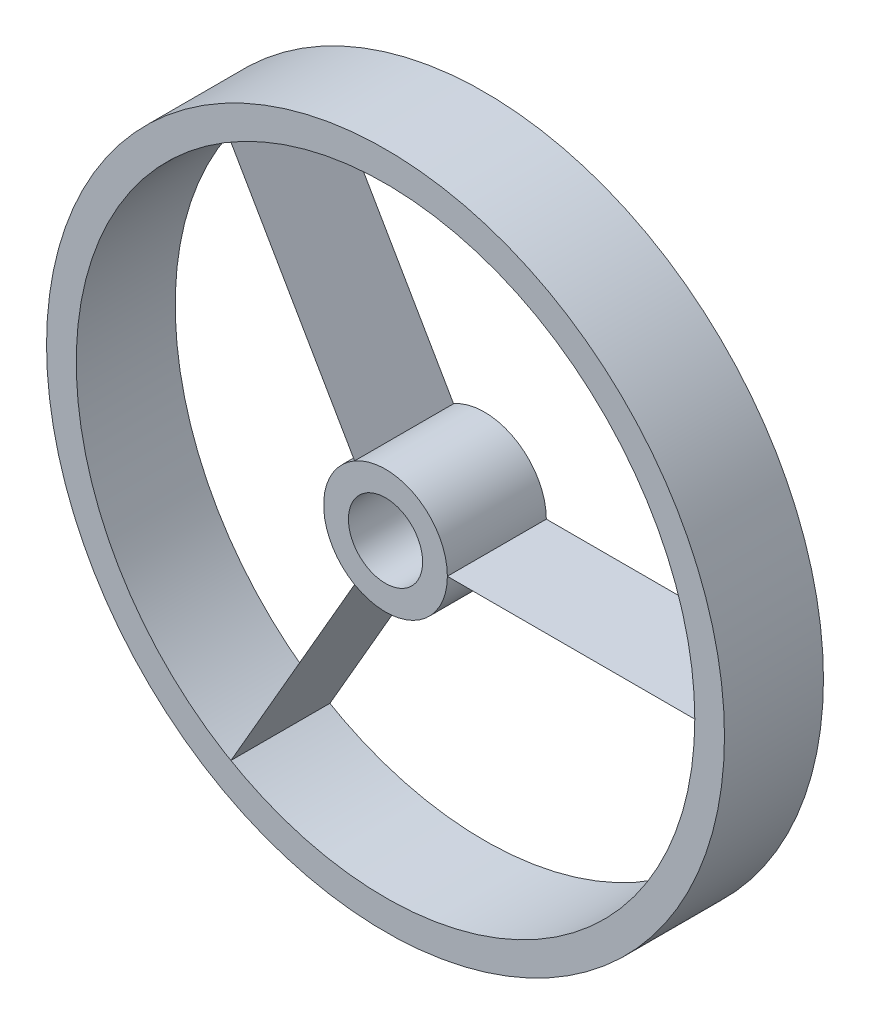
ISO-10303-21;
HEADER;
FILE_DESCRIPTION(('STEP AP214'),'2;1');
FILE_NAME('part.step','',(''),(''),'','','');
FILE_SCHEMA(('AUTOMOTIVE_DESIGN { 1 0 10303 214 1 1 1 1 }'));
ENDSEC;
DATA;
#1=APPLICATION_CONTEXT('core data for automotive mechanical design processes');
#2=APPLICATION_PROTOCOL_DEFINITION('international standard','automotive_design',2000,#1);
#3=PRODUCT_CONTEXT('',#1,'mechanical');
#4=PRODUCT('Part','Part','',(#3));
#5=PRODUCT_RELATED_PRODUCT_CATEGORY('part','',(#4));
#6=PRODUCT_DEFINITION_FORMATION('','',#4);
#7=PRODUCT_DEFINITION_CONTEXT('part definition',#1,'design');
#8=PRODUCT_DEFINITION('design','',#6,#7);
#9=PRODUCT_DEFINITION_SHAPE('','',#8);
#10=(LENGTH_UNIT() NAMED_UNIT(*) SI_UNIT(.MILLI.,.METRE.));
#11=(NAMED_UNIT(*) PLANE_ANGLE_UNIT() SI_UNIT($,.RADIAN.));
#12=(NAMED_UNIT(*) SI_UNIT($,.STERADIAN.) SOLID_ANGLE_UNIT());
#13=UNCERTAINTY_MEASURE_WITH_UNIT(LENGTH_MEASURE(1.E-05),#10,'distance_accuracy_value','');
#14=(GEOMETRIC_REPRESENTATION_CONTEXT(3) GLOBAL_UNCERTAINTY_ASSIGNED_CONTEXT((#13)) GLOBAL_UNIT_ASSIGNED_CONTEXT((#10,
#11,#12)) REPRESENTATION_CONTEXT('',''));
#15=CARTESIAN_POINT('',(0.,0.,0.));
#16=DIRECTION('',(0.,0.,1.));
#17=DIRECTION('',(1.,0.,0.));
#18=AXIS2_PLACEMENT_3D('',#15,#16,#17);
#19=CARTESIAN_POINT('',(-12.5000000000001,-21.6506350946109,40.));
#20=DIRECTION('',(0.866025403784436,-0.500000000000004,0.));
#21=DIRECTION('',(0.500000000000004,0.866025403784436,0.));
#22=AXIS2_PLACEMENT_3D('',#19,#20,#21);
#23=PLANE('',#22);
#24=DIRECTION('',(0.500000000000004,0.866025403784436,0.));
#25=VECTOR('',#24,1.);
#26=CARTESIAN_POINT('',(-12.5000000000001,-21.6506350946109,40.));
#27=LINE('',#26,#25);
#28=CARTESIAN_POINT('',(-62.5000000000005,-108.253175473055,40.));
#29=VERTEX_POINT('',#28);
#30=CARTESIAN_POINT('',(-12.5000000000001,-21.6506350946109,40.));
#31=VERTEX_POINT('',#30);
#32=EDGE_CURVE('E58',#29,#31,#27,.T.);
#33=ORIENTED_EDGE('',*,*,#32,.F.);
#34=DIRECTION('',(0.,0.,-1.));
#35=VECTOR('',#34,1.);
#36=CARTESIAN_POINT('',(-62.5000000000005,-108.253175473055,40.));
#37=LINE('',#36,#35);
#38=CARTESIAN_POINT('',(-62.5000000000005,-108.253175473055,0.));
#39=VERTEX_POINT('',#38);
#40=EDGE_CURVE('E13',#29,#39,#37,.T.);
#41=ORIENTED_EDGE('',*,*,#40,.T.);
#42=DIRECTION('',(0.500000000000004,0.866025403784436,0.));
#43=VECTOR('',#42,1.);
#44=CARTESIAN_POINT('',(-12.5000000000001,-21.6506350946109,0.));
#45=LINE('',#44,#43);
#46=CARTESIAN_POINT('',(-12.5000000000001,-21.6506350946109,0.));
#47=VERTEX_POINT('',#46);
#48=EDGE_CURVE('E73',#39,#47,#45,.T.);
#49=ORIENTED_EDGE('',*,*,#48,.T.);
#50=DIRECTION('',(0.,0.,1.));
#51=VECTOR('',#50,1.);
#52=CARTESIAN_POINT('',(-12.5000000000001,-21.6506350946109,40.));
#53=LINE('',#52,#51);
#54=EDGE_CURVE('E68',#47,#31,#53,.T.);
#55=ORIENTED_EDGE('',*,*,#54,.T.);
#56=EDGE_LOOP('',(#33,#41,#49,#55));
#57=FACE_BOUND('',#56,.T.);
#58=ADVANCED_FACE('F53',(#57),#23,.T.);
#59=OPEN_SHELL('',(#58));
#60=SHELL_BASED_SURFACE_MODEL('B2',(#59));
#61=CARTESIAN_POINT('',(25.,0.,40.));
#62=DIRECTION('',(0.,1.,0.));
#63=DIRECTION('',(0.,0.,1.));
#64=AXIS2_PLACEMENT_3D('',#61,#62,#63);
#65=PLANE('',#64);
#66=DIRECTION('',(0.,0.,1.));
#67=VECTOR('',#66,1.);
#68=CARTESIAN_POINT('',(25.,0.,40.));
#69=LINE('',#68,#67);
#70=CARTESIAN_POINT('',(25.,0.,0.));
#71=VERTEX_POINT('',#70);
#72=CARTESIAN_POINT('',(25.,0.,40.));
#73=VERTEX_POINT('',#72);
#74=EDGE_CURVE('E51',#71,#73,#69,.T.);
#75=ORIENTED_EDGE('',*,*,#74,.F.);
#76=DIRECTION('',(-1.,0.,0.));
#77=VECTOR('',#76,1.);
#78=CARTESIAN_POINT('',(25.,0.,0.));
#79=LINE('',#78,#77);
#80=CARTESIAN_POINT('',(125.,0.,0.));
#81=VERTEX_POINT('',#80);
#82=EDGE_CURVE('E126',#81,#71,#79,.T.);
#83=ORIENTED_EDGE('',*,*,#82,.F.);
#84=DIRECTION('',(0.,0.,-1.));
#85=VECTOR('',#84,1.);
#86=CARTESIAN_POINT('',(125.,0.,40.));
#87=LINE('',#86,#85);
#88=CARTESIAN_POINT('',(125.,0.,40.));
#89=VERTEX_POINT('',#88);
#90=EDGE_CURVE('E121',#89,#81,#87,.T.);
#91=ORIENTED_EDGE('',*,*,#90,.F.);
#92=DIRECTION('',(-1.,0.,0.));
#93=VECTOR('',#92,1.);
#94=CARTESIAN_POINT('',(25.,0.,40.));
#95=LINE('',#94,#93);
#96=EDGE_CURVE('E111',#89,#73,#95,.T.);
#97=ORIENTED_EDGE('',*,*,#96,.T.);
#98=EDGE_LOOP('',(#75,#83,#91,#97));
#99=FACE_BOUND('',#98,.T.);
#100=ADVANCED_FACE('F106',(#99),#65,.F.);
#101=OPEN_SHELL('',(#100));
#102=SHELL_BASED_SURFACE_MODEL('B7',(#101));
#103=CARTESIAN_POINT('',(-12.5000000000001,21.6506350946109,40.));
#104=DIRECTION('',(-0.866025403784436,-0.500000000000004,0.));
#105=DIRECTION('',(0.500000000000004,-0.866025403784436,0.));
#106=AXIS2_PLACEMENT_3D('',#103,#104,#105);
#107=PLANE('',#106);
#108=DIRECTION('',(0.,0.,1.));
#109=VECTOR('',#108,1.);
#110=CARTESIAN_POINT('',(-12.5000000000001,21.6506350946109,40.));
#111=LINE('',#110,#109);
#112=CARTESIAN_POINT('',(-12.5000000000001,21.6506350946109,0.));
#113=VERTEX_POINT('',#112);
#114=CARTESIAN_POINT('',(-12.5000000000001,21.6506350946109,40.));
#115=VERTEX_POINT('',#114);
#116=EDGE_CURVE('E104',#113,#115,#111,.T.);
#117=ORIENTED_EDGE('',*,*,#116,.F.);
#118=DIRECTION('',(0.500000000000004,-0.866025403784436,0.));
#119=VECTOR('',#118,1.);
#120=CARTESIAN_POINT('',(-12.5000000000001,21.6506350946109,0.));
#121=LINE('',#120,#119);
#122=CARTESIAN_POINT('',(-62.5000000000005,108.253175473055,0.));
#123=VERTEX_POINT('',#122);
#124=EDGE_CURVE('E177',#123,#113,#121,.T.);
#125=ORIENTED_EDGE('',*,*,#124,.F.);
#126=DIRECTION('',(0.,0.,-1.));
#127=VECTOR('',#126,1.);
#128=CARTESIAN_POINT('',(-62.5000000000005,108.253175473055,40.));
#129=LINE('',#128,#127);
#130=CARTESIAN_POINT('',(-62.5000000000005,108.253175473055,40.));
#131=VERTEX_POINT('',#130);
#132=EDGE_CURVE('E172',#131,#123,#129,.T.);
#133=ORIENTED_EDGE('',*,*,#132,.F.);
#134=DIRECTION('',(0.500000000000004,-0.866025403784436,0.));
#135=VECTOR('',#134,1.);
#136=CARTESIAN_POINT('',(-12.5000000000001,21.6506350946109,40.));
#137=LINE('',#136,#135);
#138=EDGE_CURVE('E162',#131,#115,#137,.T.);
#139=ORIENTED_EDGE('',*,*,#138,.T.);
#140=EDGE_LOOP('',(#117,#125,#133,#139));
#141=FACE_BOUND('',#140,.T.);
#142=ADVANCED_FACE('F157',(#141),#107,.F.);
#143=OPEN_SHELL('',(#142));
#144=SHELL_BASED_SURFACE_MODEL('B45',(#143));
#145=CARTESIAN_POINT('',(0.,0.,40.));
#146=DIRECTION('',(0.,0.,1.));
#147=DIRECTION('',(1.,0.,0.));
#148=AXIS2_PLACEMENT_3D('',#145,#146,#147);
#149=PLANE('',#148);
#150=CARTESIAN_POINT('',(0.,0.,40.));
#151=DIRECTION('',(0.,0.,1.));
#152=DIRECTION('',(1.,0.,0.));
#153=AXIS2_PLACEMENT_3D('',#150,#151,#152);
#154=CIRCLE('',#153,137.);
#155=CARTESIAN_POINT('',(137.,0.,40.));
#156=VERTEX_POINT('',#155);
#157=EDGE_CURVE('E156',#156,#156,#154,.T.);
#158=ORIENTED_EDGE('',*,*,#157,.T.);
#159=EDGE_LOOP('',(#158));
#160=FACE_BOUND('',#159,.T.);
#161=CARTESIAN_POINT('',(0.,0.,40.));
#162=DIRECTION('',(0.,0.,1.));
#163=DIRECTION('',(1.,0.,0.));
#164=AXIS2_PLACEMENT_3D('',#161,#162,#163);
#165=CIRCLE('',#164,125.);
#166=CARTESIAN_POINT('',(125.,0.,40.));
#167=VERTEX_POINT('',#166);
#168=EDGE_CURVE('E218',#167,#167,#165,.T.);
#169=ORIENTED_EDGE('',*,*,#168,.F.);
#170=EDGE_LOOP('',(#169));
#171=FACE_BOUND('',#170,.T.);
#172=ADVANCED_FACE('F207',(#160,#171),#149,.T.);
#173=CARTESIAN_POINT('',(0.,0.,0.));
#174=DIRECTION('',(0.,0.,1.));
#175=DIRECTION('',(1.,0.,0.));
#176=AXIS2_PLACEMENT_3D('',#173,#174,#175);
#177=PLANE('',#176);
#178=CARTESIAN_POINT('',(0.,0.,0.));
#179=DIRECTION('',(0.,0.,1.));
#180=DIRECTION('',(1.,0.,0.));
#181=AXIS2_PLACEMENT_3D('',#178,#179,#180);
#182=CIRCLE('',#181,137.);
#183=CARTESIAN_POINT('',(137.,0.,0.));
#184=VERTEX_POINT('',#183);
#185=EDGE_CURVE('E211',#184,#184,#182,.T.);
#186=ORIENTED_EDGE('',*,*,#185,.F.);
#187=EDGE_LOOP('',(#186));
#188=FACE_BOUND('',#187,.T.);
#189=CARTESIAN_POINT('',(0.,0.,0.));
#190=DIRECTION('',(0.,0.,1.));
#191=DIRECTION('',(1.,0.,0.));
#192=AXIS2_PLACEMENT_3D('',#189,#190,#191);
#193=CIRCLE('',#192,125.);
#194=CARTESIAN_POINT('',(125.,0.,0.));
#195=VERTEX_POINT('',#194);
#196=EDGE_CURVE('E220',#195,#195,#193,.T.);
#197=ORIENTED_EDGE('',*,*,#196,.T.);
#198=EDGE_LOOP('',(#197));
#199=FACE_BOUND('',#198,.T.);
#200=ADVANCED_FACE('F230',(#188,#199),#177,.F.);
#201=CARTESIAN_POINT('',(0.,0.,40.));
#202=DIRECTION('',(0.,0.,-1.));
#203=DIRECTION('',(-1.,0.,0.));
#204=AXIS2_PLACEMENT_3D('',#201,#202,#203);
#205=CYLINDRICAL_SURFACE('',#204,137.);
#206=ORIENTED_EDGE('',*,*,#157,.F.);
#207=EDGE_LOOP('',(#206));
#208=FACE_BOUND('',#207,.T.);
#209=ORIENTED_EDGE('',*,*,#185,.T.);
#210=EDGE_LOOP('',(#209));
#211=FACE_BOUND('',#210,.T.);
#212=ADVANCED_FACE('F209',(#208,#211),#205,.T.);
#213=CARTESIAN_POINT('',(0.,0.,40.));
#214=DIRECTION('',(0.,0.,-1.));
#215=DIRECTION('',(-1.,0.,0.));
#216=AXIS2_PLACEMENT_3D('',#213,#214,#215);
#217=CYLINDRICAL_SURFACE('',#216,125.);
#218=ORIENTED_EDGE('',*,*,#168,.T.);
#219=EDGE_LOOP('',(#218));
#220=FACE_BOUND('',#219,.T.);
#221=ORIENTED_EDGE('',*,*,#196,.F.);
#222=EDGE_LOOP('',(#221));
#223=FACE_BOUND('',#222,.T.);
#224=ADVANCED_FACE('F226',(#220,#223),#217,.F.);
#225=CLOSED_SHELL('',(#172,#200,#212,#224));
#226=MANIFOLD_SOLID_BREP('B98',#225);
#227=CARTESIAN_POINT('',(0.,0.,40.));
#228=DIRECTION('',(0.,0.,-1.));
#229=DIRECTION('',(-1.,0.,0.));
#230=AXIS2_PLACEMENT_3D('',#227,#228,#229);
#231=CYLINDRICAL_SURFACE('',#230,25.);
#232=CARTESIAN_POINT('',(0.,0.,40.));
#233=DIRECTION('',(0.,0.,1.));
#234=DIRECTION('',(1.,0.,0.));
#235=AXIS2_PLACEMENT_3D('',#232,#233,#234);
#236=CIRCLE('',#235,25.);
#237=CARTESIAN_POINT('',(25.,0.,40.));
#238=VERTEX_POINT('',#237);
#239=EDGE_CURVE('E206',#238,#238,#236,.T.);
#240=ORIENTED_EDGE('',*,*,#239,.F.);
#241=EDGE_LOOP('',(#240));
#242=FACE_BOUND('',#241,.T.);
#243=CARTESIAN_POINT('',(0.,0.,0.));
#244=DIRECTION('',(0.,0.,1.));
#245=DIRECTION('',(1.,0.,0.));
#246=AXIS2_PLACEMENT_3D('',#243,#244,#245);
#247=CIRCLE('',#246,25.);
#248=CARTESIAN_POINT('',(25.,0.,0.));
#249=VERTEX_POINT('',#248);
#250=EDGE_CURVE('E271',#249,#249,#247,.T.);
#251=ORIENTED_EDGE('',*,*,#250,.T.);
#252=EDGE_LOOP('',(#251));
#253=FACE_BOUND('',#252,.T.);
#254=ADVANCED_FACE('F268',(#242,#253),#231,.T.);
#255=CARTESIAN_POINT('',(0.,0.,40.));
#256=DIRECTION('',(0.,0.,1.));
#257=DIRECTION('',(1.,0.,0.));
#258=AXIS2_PLACEMENT_3D('',#255,#256,#257);
#259=PLANE('',#258);
#260=CARTESIAN_POINT('',(0.,0.,40.));
#261=DIRECTION('',(0.,0.,1.));
#262=DIRECTION('',(1.,0.,0.));
#263=AXIS2_PLACEMENT_3D('',#260,#261,#262);
#264=CIRCLE('',#263,15.);
#265=CARTESIAN_POINT('',(15.,0.,40.));
#266=VERTEX_POINT('',#265);
#267=EDGE_CURVE('E280',#266,#266,#264,.T.);
#268=ORIENTED_EDGE('',*,*,#267,.F.);
#269=EDGE_LOOP('',(#268));
#270=FACE_BOUND('',#269,.T.);
#271=ORIENTED_EDGE('',*,*,#239,.T.);
#272=EDGE_LOOP('',(#271));
#273=FACE_BOUND('',#272,.T.);
#274=ADVANCED_FACE('F295',(#270,#273),#259,.T.);
#275=CARTESIAN_POINT('',(0.,0.,0.));
#276=DIRECTION('',(0.,0.,1.));
#277=DIRECTION('',(1.,0.,0.));
#278=AXIS2_PLACEMENT_3D('',#275,#276,#277);
#279=PLANE('',#278);
#280=CARTESIAN_POINT('',(0.,0.,0.));
#281=DIRECTION('',(0.,0.,1.));
#282=DIRECTION('',(1.,0.,0.));
#283=AXIS2_PLACEMENT_3D('',#280,#281,#282);
#284=CIRCLE('',#283,15.);
#285=CARTESIAN_POINT('',(15.,0.,0.));
#286=VERTEX_POINT('',#285);
#287=EDGE_CURVE('E278',#286,#286,#284,.T.);
#288=ORIENTED_EDGE('',*,*,#287,.T.);
#289=EDGE_LOOP('',(#288));
#290=FACE_BOUND('',#289,.T.);
#291=ORIENTED_EDGE('',*,*,#250,.F.);
#292=EDGE_LOOP('',(#291));
#293=FACE_BOUND('',#292,.T.);
#294=ADVANCED_FACE('F286',(#290,#293),#279,.F.);
#295=CARTESIAN_POINT('',(0.,0.,0.));
#296=DIRECTION('',(0.,0.,1.));
#297=DIRECTION('',(1.,0.,0.));
#298=AXIS2_PLACEMENT_3D('',#295,#296,#297);
#299=CYLINDRICAL_SURFACE('',#298,15.);
#300=ORIENTED_EDGE('',*,*,#287,.F.);
#301=EDGE_LOOP('',(#300));
#302=FACE_BOUND('',#301,.T.);
#303=ORIENTED_EDGE('',*,*,#267,.T.);
#304=EDGE_LOOP('',(#303));
#305=FACE_BOUND('',#304,.T.);
#306=ADVANCED_FACE('F289',(#302,#305),#299,.F.);
#307=CLOSED_SHELL('',(#254,#274,#294,#306));
#308=MANIFOLD_SOLID_BREP('B151',#307);
#309=ADVANCED_BREP_SHAPE_REPRESENTATION('',(#18,#226,#308),#14);
#310=MANIFOLD_SURFACE_SHAPE_REPRESENTATION('',(#18,#60,#102,#144),#14);
#311=SHAPE_REPRESENTATION('',(#18),#14);
#312=SHAPE_DEFINITION_REPRESENTATION(#9,#311);
#313=SHAPE_REPRESENTATION_RELATIONSHIP('','',#311,#309);
#314=SHAPE_REPRESENTATION_RELATIONSHIP('','',#311,#310);
ENDSEC;
END-ISO-10303-21;
